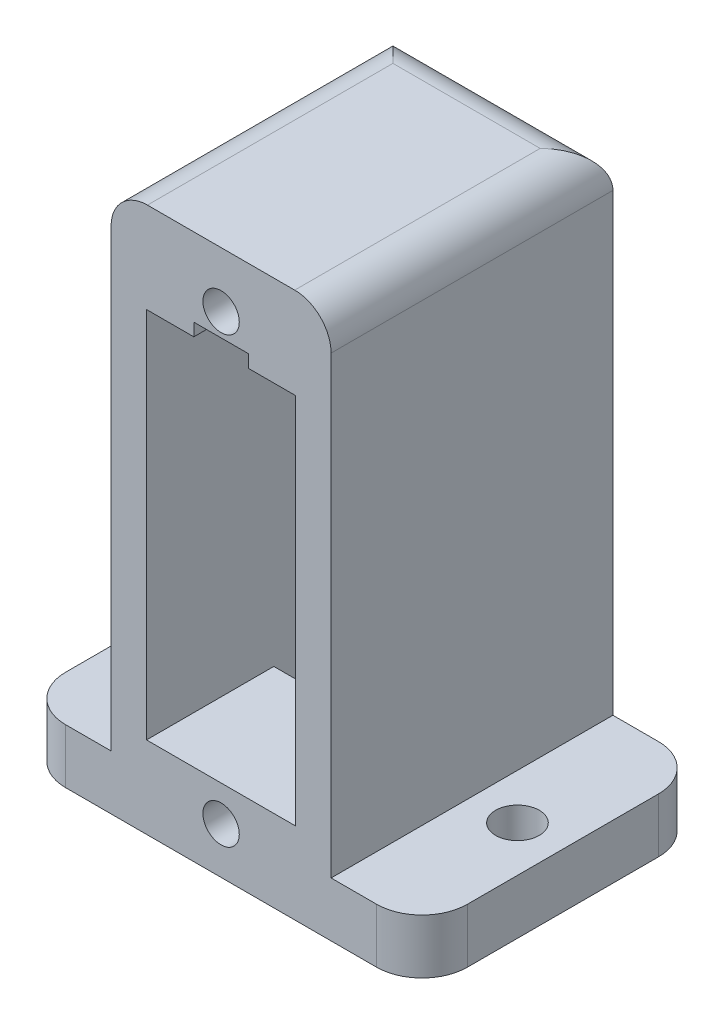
from build123d import *

# Parameters (mm, degrees)
ESQUISSE1_W             = 12.1
ESQUISSE1_H             = 30
BOSS_EXTRU_1_DEPTH      = 15.5
ESQUISSE2_R             = 1
ENL_V_MAT_EXTRU_1_DEPTH = 13.5
ESQUISSE3_W             = 8.2
ESQUISSE3_H             = 8.5
ENL_V_MAT_EXTRU_2_DEPTH = 4.5
CONG_1_R                = 2
ESQUISSE4_R             = 1.2
BOSS_EXTRU_2_DEPTH      = 3


with BuildPart() as part:
    # Esquisse1 → Boss.-Extru.1 (new body)
    with BuildSketch(Plane.XY):
        with Locations((6.05, 15)):
            Rectangle(ESQUISSE1_W, ESQUISSE1_H)
    extrude(amount=BOSS_EXTRU_1_DEPTH)

    # Esquisse2 → Enl_v. mat.-Extru.1 (cut)
    with BuildSketch(Plane.XY.offset(15.5)):
        with Locations((6.05, 26.95)):
            Circle(ESQUISSE2_R)
        with Locations(Location((6.05, 2.55, 0), (0, 0, 180))):
            Circle(ESQUISSE2_R)
        Polygon((1.95, 25), (4.55, 25), (4.55, 25.7), (7.55, 25.7), (7.55, 25), (10.15, 25), (10.15, 4.5), (1.95, 4.5), align=None)
    extrude(amount=-ENL_V_MAT_EXTRU_1_DEPTH, mode=Mode.SUBTRACT)

    # Esquisse3 → Enl_v. mat.-Extru.2 (cut)
    with BuildSketch(Plane.XZ):
        with Locations((6.05, 4.25)):
            Rectangle(ESQUISSE3_W, ESQUISSE3_H)
    extrude(amount=-ENL_V_MAT_EXTRU_2_DEPTH, mode=Mode.SUBTRACT)

    # Cong_1
    cong_1_edges = [part.edges().sort_by_distance(p)[0] for p in [
        (6.05, 30, 0),
        (0, 30, 7.75),
        (12.1, 30, 7.75),
    ]]
    fillet(cong_1_edges, radius=CONG_1_R)

    # Esquisse4 → Boss.-Extru.2 (add)
    # profile 1 of 2: a face of its own
    with BuildSketch(Plane.XZ):
        with BuildLine():
            Line((14.6, 0), (11.496628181, 0))
            Line((11.496628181, 0), (11.496628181, 15.5))
            Line((11.496628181, 15.5), (14.6, 15.5))
            ThreePointArc((14.6, 15.5), (16.367766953, 14.767766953), (17.1, 13))
            Line((17.1, 13), (17.1, 2.5))
            ThreePointArc((17.1, 2.5), (16.367766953, 0.732233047), (14.6, 0))
        make_face()
        with Locations(Location((14.6, 7.75, 0), (0, 0, 270))):
            Circle(ESQUISSE4_R, mode=Mode.SUBTRACT)
    # profile 2 of 2: a face of its own
    with BuildSketch(Plane.XZ):
        with BuildLine():
            Line((-2.5, 15.5), (0.603371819, 15.5))
            Line((0.603371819, 15.5), (0.603371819, 0))
            Line((0.603371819, 0), (-2.5, 0))
            ThreePointArc((-2.5, 0), (-4.267766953, 0.732233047), (-5, 2.5))
            Line((-5, 2.5), (-5, 13))
            ThreePointArc((-5, 13), (-4.267766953, 14.767766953), (-2.5, 15.5))
        make_face()
        with Locations(Location((-2.5, 7.75, 0), (0, 0, 90))):
            Circle(ESQUISSE4_R, mode=Mode.SUBTRACT)
    extrude(amount=-BOSS_EXTRU_2_DEPTH)


solid = part.part
